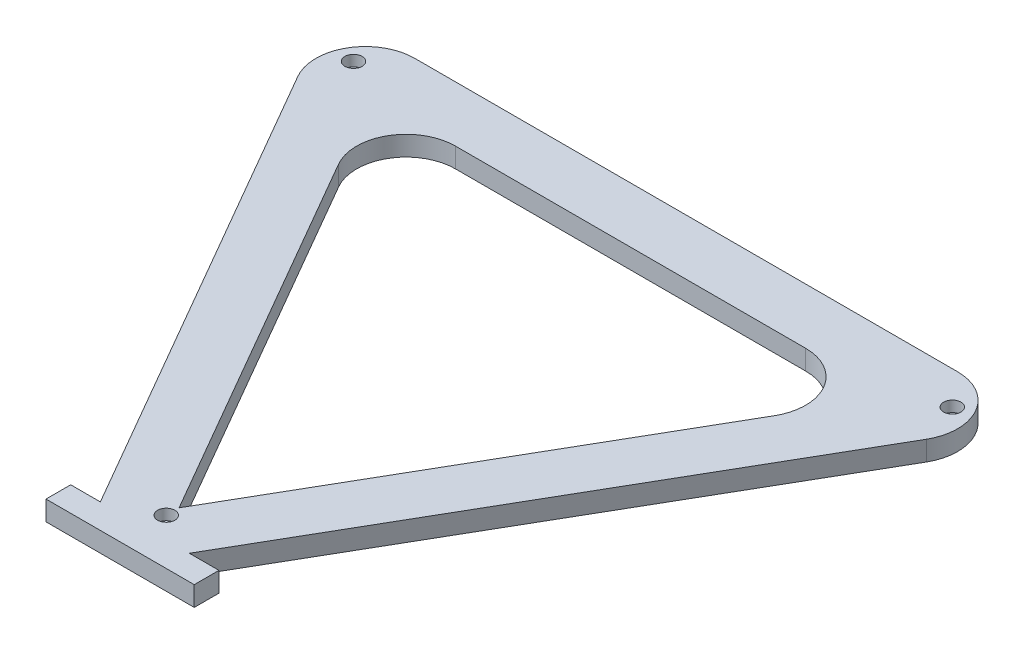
from build123d import *

# Parameters (mm, degrees)
BOSS_EXTRUDE1_DEPTH = 4
SKETCH2_R           = 1.75
CUT_EXTRUDE1_DEPTH  = 2.2


with BuildPart() as part:
    # Sketch1 → Boss-Extrude1 (new body)
    with BuildSketch(Plane(origin=(0, 0, 0), x_dir=(1, 0, 0), z_dir=(0, 1, 0))):
        with BuildLine():
            Line((-50.552239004, -73.99659536), (-105.141984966, 20.555618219))
            ThreePointArc((-105.141984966, 20.555618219), (-106.481730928, 25.555618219), (-105.141984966, 30.555618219))
            ThreePointArc((-105.141984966, 30.555618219), (-101.481730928, 34.215872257), (-96.481730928, 35.555618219))
            Line((-96.481730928, 35.555618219), (13.37725292, 35.555618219))
            ThreePointArc((13.37725292, 35.555618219), (18.37725292, 34.215872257), (22.037506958, 30.555618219))
            ThreePointArc((22.037506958, 30.555618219), (23.37725292, 25.555618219), (22.037506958, 20.555618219))
            Line((22.037506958, 20.555618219), (-32.552239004, -73.99659536))
            Line((-32.552239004, -73.99659536), (-26.552239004, -73.99659536))
            Line((-26.552239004, -73.99659536), (-26.552239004, -78.99659536))
            Line((-26.552239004, -78.99659536), (-36.552239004, -78.99659536))
            Line((-36.552239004, -78.99659536), (-46.552239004, -78.99659536))
            Line((-46.552239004, -78.99659536), (-56.552239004, -78.99659536))
            Line((-56.552239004, -78.99659536), (-56.552239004, -73.99659536))
            Line((-56.552239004, -73.99659536), (-50.552239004, -73.99659536))
        make_face()
        with BuildLine():
            Line((2.537506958, 9.29728797), (-41.552239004, -67.068392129))
            Line((-41.552239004, -67.068392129), (-85.641984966, 9.29728797))
            ThreePointArc((-85.641984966, 9.29728797), (-86.981730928, 14.29728797), (-85.641984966, 19.29728797))
            ThreePointArc((-85.641984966, 19.29728797), (-81.981730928, 22.957542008), (-76.981730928, 24.29728797))
            Line((-76.981730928, 24.29728797), (-6.12274708, 24.29728797))
            ThreePointArc((-6.12274708, 24.29728797), (-1.12274708, 22.957542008), (2.537506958, 19.29728797))
            ThreePointArc((2.537506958, 19.29728797), (3.87725292, 14.29728797), (2.537506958, 9.29728797))
        make_face(mode=Mode.SUBTRACT)
    extrude(amount=BOSS_EXTRUDE1_DEPTH)

    # Sketch2 → Cut-Extrude1 (cut)
    with BuildSketch(Plane(origin=(0, 4, 0), x_dir=(1, 0, 0), z_dir=(0, 1, 0))):
        with Locations(Location((-41.552239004, -69.666468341, 0), (0, 0, 270))):
            Circle(SKETCH2_R)
        with Locations(Location((-102.141984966, 28.823567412, 0), (0, 0, 270))):
            Circle(SKETCH2_R)
        with Locations(Location((19.037506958, 28.823567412, 0), (0, 0, 270))):
            Circle(SKETCH2_R)
    extrude(amount=-CUT_EXTRUDE1_DEPTH, mode=Mode.SUBTRACT)


solid = part.part
